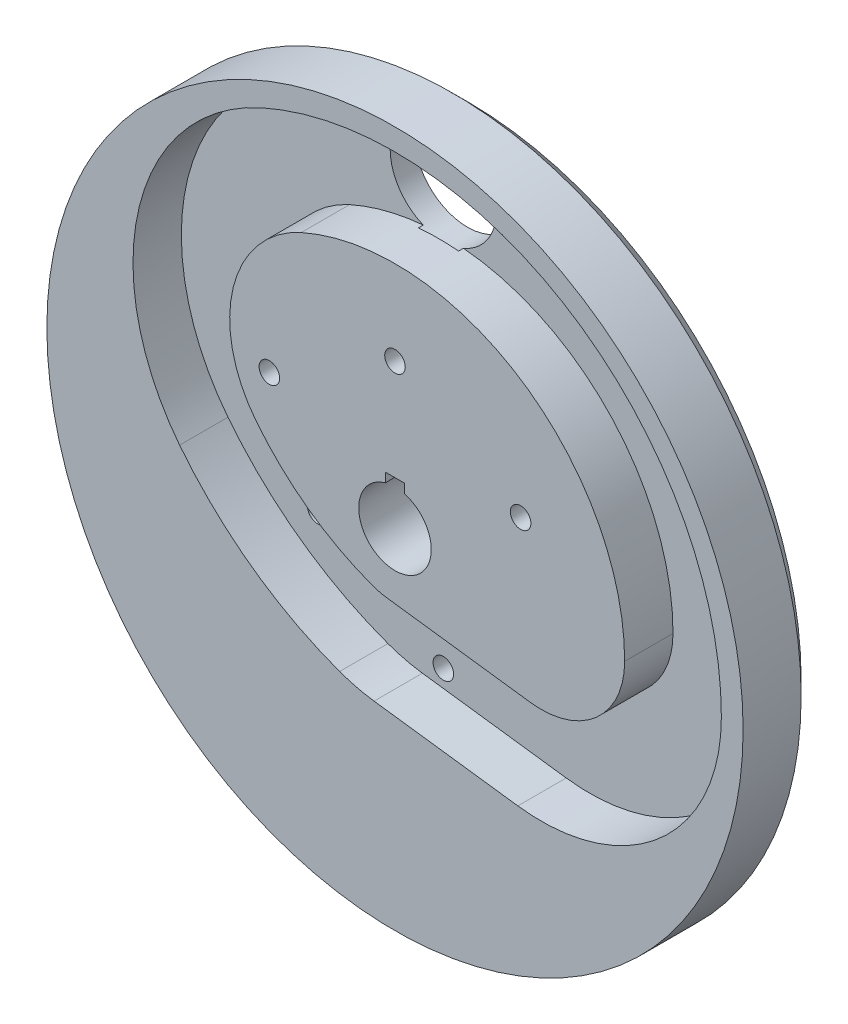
from build123d import *

# Parameters (mm, degrees)
ESQUISSE2_R                = 144
BASE_EXTRUSION_DEPTH       = 30
ENL_V_MAT_EXTRU_1_DEPTH    = 20
ENL_V_MAT_EXTRU_2_DEPTH    = 206.844601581
TROU_TARAUD_M10X1_51_D     = 8.5
TROU_TARAUD_M10X1_52_D     = 8.5
TROU_TARAUD_M10X1_52_DEPTH = 27.5
TROU_TARAUD_M10X1_52_TIP   = 2.553657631
TROU_TARAUD_M10X1_53_D     = 8.5
ESQUISSE12_R               = 22
ENL_V_MAT_EXTRU_3_DEPTH    = 12
CHANFREIN6_SIZE            = 6


with BuildPart() as part:
    # Esquisse2 → Base-Extrusion (new body)
    with BuildSketch(Plane.XY):
        Circle(ESQUISSE2_R)
    extrude(amount=-BASE_EXTRUSION_DEPTH)

    # Esquisse1 → Enl_v. mat.-Extru.1 (cut)
    with BuildSketch(Plane.XY):
        with BuildLine():
            Line((-8.651721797, -66.072764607), (50.816857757, -73.868297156))
            ThreePointArc((50.816857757, -73.868297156), (109.637012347, -55.9985945), (135.000258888, 0))
            ThreePointArc((135.000258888, 0), (73.434440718, 113.280416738), (-55.109788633, 123.23952733))
            ThreePointArc((-55.109788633, 123.23952733), (-105.754507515, 62.619448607), (-89.084227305, -14.593136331))
            ThreePointArc((-89.084227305, -14.593136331), (-59.330462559, -43.190679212), (-22.899485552, -62.578559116))
            ThreePointArc((-22.899485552, -62.578559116), (-15.872052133, -64.718934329), (-8.651721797, -66.072764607))
        make_face()
        with BuildLine():
            Line((-3.461873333, -26.409063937), (56.016076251, -34.205823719))
            ThreePointArc((56.016076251, -34.205823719), (83.25363126, -25.930989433), (94.998462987, 0))
            ThreePointArc((94.998462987, 0), (51.675152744, 79.714406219), (-38.780260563, 86.722542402))
            ThreePointArc((-38.780260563, 86.722542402), (-66.91520491, 53.04593053), (-57.654270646, 10.151590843))
            ThreePointArc((-57.654270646, 10.151590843), (-35.852823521, -10.803271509), (-9.159036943, -25.010703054))
            ThreePointArc((-9.159036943, -25.010703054), (-6.349070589, -25.867209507), (-3.461873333, -26.409063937))
        make_face(mode=Mode.SUBTRACT)
    extrude(amount=-ENL_V_MAT_EXTRU_1_DEPTH, mode=Mode.SUBTRACT)

    # Esquisse3 → Enl_v. mat.-Extru.2 (cut, through all)
    with BuildSketch(Plane.XY):
        with BuildLine():
            Line((-4, 18.3), (-4, 14.456832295))
            ThreePointArc((-4, 14.456832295), (0, -15), (4, 14.456832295))
            Line((4, 14.456832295), (4, 18.3))
            Line((4, 18.3), (-4, 18.3))
        make_face()
    extrude(amount=-ENL_V_MAT_EXTRU_2_DEPTH, mode=Mode.SUBTRACT)

    # Trou taraud_ M10x1.51 (through all)
    with Locations(Plane(origin=(0, 60, 0), x_dir=(1, 0, 0), z_dir=(0, 0, 1))):
        with Locations((0, 0), (51.961524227, -30), (-51.961524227, -30)):
            Hole(TROU_TARAUD_M10X1_51_D / 2)

    # Trou taraud_ M10x1.52
    with Locations(Plane(origin=(-51.961524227, -30, -20), x_dir=(1, 0, 0), z_dir=(0, 0, 1))):
        with Locations((0, 0), (51.961524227, -30)):
            Hole(TROU_TARAUD_M10X1_52_D / 2, depth=TROU_TARAUD_M10X1_52_DEPTH)
            with Locations((0, 0, -(TROU_TARAUD_M10X1_52_DEPTH + TROU_TARAUD_M10X1_52_TIP / 2))):  # 118° drill point
                Cone(0, TROU_TARAUD_M10X1_52_D / 2, TROU_TARAUD_M10X1_52_TIP, mode=Mode.SUBTRACT)

    # Trou taraud_ M10x1.53 (through all)
    with Locations(Plane(origin=(0, -60, -20), x_dir=(1, 0, 0), z_dir=(0, 0, 1))):
        with Locations((0, 0)):
            Hole(TROU_TARAUD_M10X1_53_D / 2)

    # Esquisse12 → Enl_v. mat.-Extru.3 (cut)
    with BuildSketch(Plane(origin=(0, 0, -30), x_dir=(-1, 0, 0), z_dir=(0, 0, -1))):
        with Locations((0, 115)):
            Circle(ESQUISSE12_R)
    extrude(amount=-ENL_V_MAT_EXTRU_3_DEPTH, mode=Mode.SUBTRACT)

    # Chanfrein6
    chanfrein6_edges = [part.edges().sort_by_distance(p)[0] for p in [
        (-144, 0, -30),
    ]]
    chamfer(chanfrein6_edges, length=CHANFREIN6_SIZE)


solid = part.part
